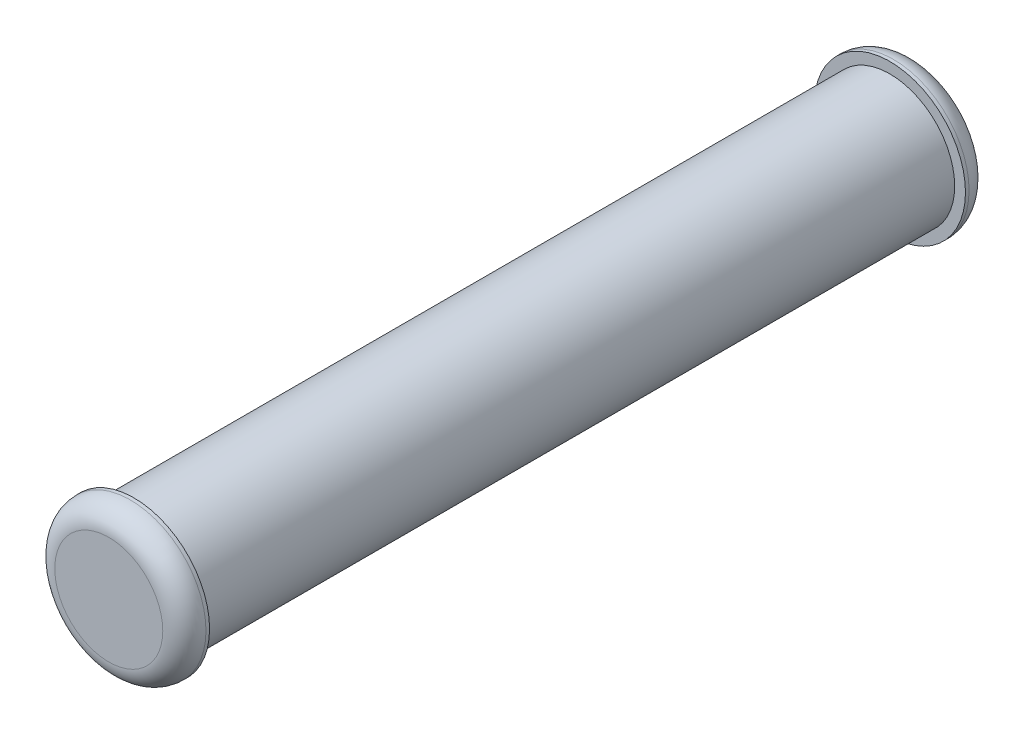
ISO-10303-21;
HEADER;
FILE_DESCRIPTION(('STEP AP214'),'2;1');
FILE_NAME('part.step','',(''),(''),'','','');
FILE_SCHEMA(('AUTOMOTIVE_DESIGN { 1 0 10303 214 1 1 1 1 }'));
ENDSEC;
DATA;
#1=APPLICATION_CONTEXT('core data for automotive mechanical design processes');
#2=APPLICATION_PROTOCOL_DEFINITION('international standard','automotive_design',2000,#1);
#3=PRODUCT_CONTEXT('',#1,'mechanical');
#4=PRODUCT('Part','Part','',(#3));
#5=PRODUCT_RELATED_PRODUCT_CATEGORY('part','',(#4));
#6=PRODUCT_DEFINITION_FORMATION('','',#4);
#7=PRODUCT_DEFINITION_CONTEXT('part definition',#1,'design');
#8=PRODUCT_DEFINITION('design','',#6,#7);
#9=PRODUCT_DEFINITION_SHAPE('','',#8);
#10=(LENGTH_UNIT() NAMED_UNIT(*) SI_UNIT(.MILLI.,.METRE.));
#11=(NAMED_UNIT(*) PLANE_ANGLE_UNIT() SI_UNIT($,.RADIAN.));
#12=(NAMED_UNIT(*) SI_UNIT($,.STERADIAN.) SOLID_ANGLE_UNIT());
#13=UNCERTAINTY_MEASURE_WITH_UNIT(LENGTH_MEASURE(1.E-05),#10,'distance_accuracy_value','');
#14=(GEOMETRIC_REPRESENTATION_CONTEXT(3) GLOBAL_UNCERTAINTY_ASSIGNED_CONTEXT((#13)) GLOBAL_UNIT_ASSIGNED_CONTEXT((#10,
#11,#12)) REPRESENTATION_CONTEXT('',''));
#15=CARTESIAN_POINT('',(0.,0.,0.));
#16=DIRECTION('',(0.,0.,1.));
#17=DIRECTION('',(1.,0.,0.));
#18=AXIS2_PLACEMENT_3D('',#15,#16,#17);
#19=CARTESIAN_POINT('',(0.,0.899999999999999,5.25));
#20=DIRECTION('',(0.,0.,1.));
#21=DIRECTION('',(1.,0.,0.));
#22=AXIS2_PLACEMENT_3D('',#19,#20,#21);
#23=PLANE('',#22);
#24=CARTESIAN_POINT('',(0.,0.,5.25));
#25=DIRECTION('',(0.,0.,1.));
#26=DIRECTION('',(1.,0.,0.));
#27=AXIS2_PLACEMENT_3D('',#24,#25,#26);
#28=CIRCLE('',#27,1.05);
#29=CARTESIAN_POINT('',(1.05,0.,5.25));
#30=VERTEX_POINT('',#29);
#31=EDGE_CURVE('E57',#30,#30,#28,.T.);
#32=ORIENTED_EDGE('',*,*,#31,.F.);
#33=EDGE_LOOP('',(#32));
#34=FACE_BOUND('',#33,.T.);
#35=CARTESIAN_POINT('',(0.,0.,5.25));
#36=DIRECTION('',(0.,0.,1.));
#37=DIRECTION('',(1.,0.,0.));
#38=AXIS2_PLACEMENT_3D('',#35,#36,#37);
#39=CIRCLE('',#38,0.899999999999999);
#40=CARTESIAN_POINT('',(0.899999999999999,0.,5.25));
#41=VERTEX_POINT('',#40);
#42=EDGE_CURVE('E10',#41,#41,#39,.T.);
#43=ORIENTED_EDGE('',*,*,#42,.T.);
#44=EDGE_LOOP('',(#43));
#45=FACE_BOUND('',#44,.T.);
#46=ADVANCED_FACE('F29',(#34,#45),#23,.F.);
#47=CARTESIAN_POINT('',(0.,0.,13.5));
#48=DIRECTION('',(0.,0.,1.));
#49=DIRECTION('',(1.,0.,0.));
#50=AXIS2_PLACEMENT_3D('',#47,#48,#49);
#51=CYLINDRICAL_SURFACE('',#50,0.899999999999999);
#52=ORIENTED_EDGE('',*,*,#42,.F.);
#53=EDGE_LOOP('',(#52));
#54=FACE_BOUND('',#53,.T.);
#55=CARTESIAN_POINT('',(0.,0.,-5.25));
#56=DIRECTION('',(0.,0.,1.));
#57=DIRECTION('',(1.,0.,0.));
#58=AXIS2_PLACEMENT_3D('',#55,#56,#57);
#59=CIRCLE('',#58,0.9);
#60=CARTESIAN_POINT('',(0.9,0.,-5.25));
#61=VERTEX_POINT('',#60);
#62=EDGE_CURVE('E35',#61,#61,#59,.T.);
#63=ORIENTED_EDGE('',*,*,#62,.T.);
#64=EDGE_LOOP('',(#63));
#65=FACE_BOUND('',#64,.T.);
#66=ADVANCED_FACE('F64',(#54,#65),#51,.T.);
#67=CARTESIAN_POINT('',(0.,0.9,-5.25));
#68=DIRECTION('',(0.,0.,-1.));
#69=DIRECTION('',(-1.,0.,0.));
#70=AXIS2_PLACEMENT_3D('',#67,#68,#69);
#71=PLANE('',#70);
#72=ORIENTED_EDGE('',*,*,#62,.F.);
#73=EDGE_LOOP('',(#72));
#74=FACE_BOUND('',#73,.T.);
#75=CARTESIAN_POINT('',(0.,0.,-5.25));
#76=DIRECTION('',(0.,0.,1.));
#77=DIRECTION('',(1.,0.,0.));
#78=AXIS2_PLACEMENT_3D('',#75,#76,#77);
#79=CIRCLE('',#78,1.05);
#80=CARTESIAN_POINT('',(1.05,0.,-5.25));
#81=VERTEX_POINT('',#80);
#82=EDGE_CURVE('E39',#81,#81,#79,.T.);
#83=ORIENTED_EDGE('',*,*,#82,.T.);
#84=EDGE_LOOP('',(#83));
#85=FACE_BOUND('',#84,.T.);
#86=ADVANCED_FACE('F68',(#74,#85),#71,.F.);
#87=CARTESIAN_POINT('',(0.,0.,13.5));
#88=DIRECTION('',(0.,0.,1.));
#89=DIRECTION('',(1.,0.,0.));
#90=AXIS2_PLACEMENT_3D('',#87,#88,#89);
#91=CYLINDRICAL_SURFACE('',#90,1.05);
#92=ORIENTED_EDGE('',*,*,#82,.F.);
#93=EDGE_LOOP('',(#92));
#94=FACE_BOUND('',#93,.T.);
#95=CARTESIAN_POINT('',(0.,0.,-5.3));
#96=DIRECTION('',(0.,0.,1.));
#97=DIRECTION('',(1.,0.,0.));
#98=AXIS2_PLACEMENT_3D('',#95,#96,#97);
#99=CIRCLE('',#98,1.05);
#100=CARTESIAN_POINT('',(1.05,0.,-5.3));
#101=VERTEX_POINT('',#100);
#102=EDGE_CURVE('E43',#101,#101,#99,.T.);
#103=ORIENTED_EDGE('',*,*,#102,.T.);
#104=EDGE_LOOP('',(#103));
#105=FACE_BOUND('',#104,.T.);
#106=ADVANCED_FACE('F73',(#94,#105),#91,.T.);
#107=CARTESIAN_POINT('',(0.,0.,-5.3));
#108=DIRECTION('',(0.,0.,1.));
#109=DIRECTION('',(1.,0.,0.));
#110=AXIS2_PLACEMENT_3D('',#107,#108,#109);
#111=TOROIDAL_SURFACE('',#110,0.750000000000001,0.299999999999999);
#112=ORIENTED_EDGE('',*,*,#102,.F.);
#113=EDGE_LOOP('',(#112));
#114=FACE_BOUND('',#113,.T.);
#115=CARTESIAN_POINT('',(0.,0.,-5.6));
#116=DIRECTION('',(0.,0.,1.));
#117=DIRECTION('',(1.,0.,0.));
#118=AXIS2_PLACEMENT_3D('',#115,#116,#117);
#119=CIRCLE('',#118,0.750000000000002);
#120=CARTESIAN_POINT('',(0.750000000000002,0.,-5.6));
#121=VERTEX_POINT('',#120);
#122=EDGE_CURVE('E48',#121,#121,#119,.T.);
#123=ORIENTED_EDGE('',*,*,#122,.T.);
#124=EDGE_LOOP('',(#123));
#125=FACE_BOUND('',#124,.T.);
#126=ADVANCED_FACE('F79',(#114,#125),#111,.T.);
#127=CARTESIAN_POINT('',(0.,0.750000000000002,-5.6));
#128=DIRECTION('',(0.,0.,1.));
#129=DIRECTION('',(1.,0.,0.));
#130=AXIS2_PLACEMENT_3D('',#127,#128,#129);
#131=PLANE('',#130);
#132=ORIENTED_EDGE('',*,*,#122,.F.);
#133=EDGE_LOOP('',(#132));
#134=FACE_BOUND('',#133,.T.);
#135=ADVANCED_FACE('F83',(#134),#131,.F.);
#136=CARTESIAN_POINT('',(0.,0.75,5.6));
#137=DIRECTION('',(0.,0.,-1.));
#138=DIRECTION('',(-1.,0.,0.));
#139=AXIS2_PLACEMENT_3D('',#136,#137,#138);
#140=PLANE('',#139);
#141=CARTESIAN_POINT('',(0.,0.,5.6));
#142=DIRECTION('',(0.,0.,1.));
#143=DIRECTION('',(1.,0.,0.));
#144=AXIS2_PLACEMENT_3D('',#141,#142,#143);
#145=CIRCLE('',#144,0.75);
#146=CARTESIAN_POINT('',(0.75,0.,5.6));
#147=VERTEX_POINT('',#146);
#148=EDGE_CURVE('E51',#147,#147,#145,.T.);
#149=ORIENTED_EDGE('',*,*,#148,.T.);
#150=EDGE_LOOP('',(#149));
#151=FACE_BOUND('',#150,.T.);
#152=ADVANCED_FACE('F87',(#151),#140,.F.);
#153=CARTESIAN_POINT('',(0.,0.,5.3));
#154=DIRECTION('',(0.,0.,1.));
#155=DIRECTION('',(1.,0.,0.));
#156=AXIS2_PLACEMENT_3D('',#153,#154,#155);
#157=TOROIDAL_SURFACE('',#156,0.75,0.299999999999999);
#158=ORIENTED_EDGE('',*,*,#148,.F.);
#159=EDGE_LOOP('',(#158));
#160=FACE_BOUND('',#159,.T.);
#161=CARTESIAN_POINT('',(0.,0.,5.3));
#162=DIRECTION('',(0.,0.,1.));
#163=DIRECTION('',(1.,0.,0.));
#164=AXIS2_PLACEMENT_3D('',#161,#162,#163);
#165=CIRCLE('',#164,1.05);
#166=CARTESIAN_POINT('',(1.05,0.,5.3));
#167=VERTEX_POINT('',#166);
#168=EDGE_CURVE('E54',#167,#167,#165,.T.);
#169=ORIENTED_EDGE('',*,*,#168,.T.);
#170=EDGE_LOOP('',(#169));
#171=FACE_BOUND('',#170,.T.);
#172=ADVANCED_FACE('F91',(#160,#171),#157,.T.);
#173=CARTESIAN_POINT('',(0.,0.,13.5));
#174=DIRECTION('',(0.,0.,1.));
#175=DIRECTION('',(1.,0.,0.));
#176=AXIS2_PLACEMENT_3D('',#173,#174,#175);
#177=CYLINDRICAL_SURFACE('',#176,1.05);
#178=ORIENTED_EDGE('',*,*,#168,.F.);
#179=EDGE_LOOP('',(#178));
#180=FACE_BOUND('',#179,.T.);
#181=ORIENTED_EDGE('',*,*,#31,.T.);
#182=EDGE_LOOP('',(#181));
#183=FACE_BOUND('',#182,.T.);
#184=ADVANCED_FACE('F61',(#180,#183),#177,.T.);
#185=CLOSED_SHELL('',(#46,#66,#86,#106,#126,#135,#152,#172,#184));
#186=MANIFOLD_SOLID_BREP('B2',#185);
#187=ADVANCED_BREP_SHAPE_REPRESENTATION('',(#18,#186),#14);
#188=SHAPE_DEFINITION_REPRESENTATION(#9,#187);
ENDSEC;
END-ISO-10303-21;
